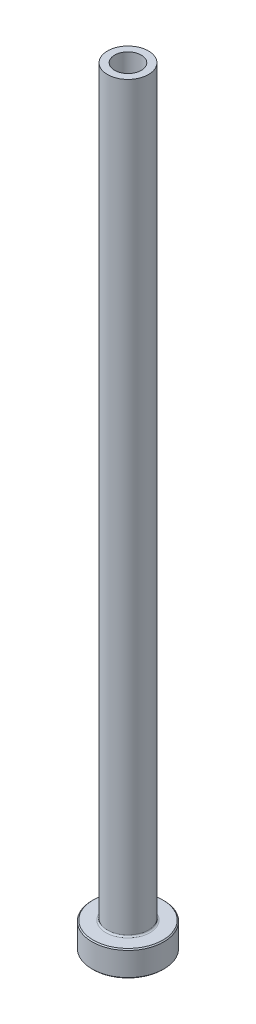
ISO-10303-21;
HEADER;
FILE_DESCRIPTION(('STEP AP214'),'2;1');
FILE_NAME('part.step','',(''),(''),'','','');
FILE_SCHEMA(('AUTOMOTIVE_DESIGN { 1 0 10303 214 1 1 1 1 }'));
ENDSEC;
DATA;
#1=APPLICATION_CONTEXT('core data for automotive mechanical design processes');
#2=APPLICATION_PROTOCOL_DEFINITION('international standard','automotive_design',2000,#1);
#3=PRODUCT_CONTEXT('',#1,'mechanical');
#4=PRODUCT('Part','Part','',(#3));
#5=PRODUCT_RELATED_PRODUCT_CATEGORY('part','',(#4));
#6=PRODUCT_DEFINITION_FORMATION('','',#4);
#7=PRODUCT_DEFINITION_CONTEXT('part definition',#1,'design');
#8=PRODUCT_DEFINITION('design','',#6,#7);
#9=PRODUCT_DEFINITION_SHAPE('','',#8);
#10=(LENGTH_UNIT() NAMED_UNIT(*) SI_UNIT(.MILLI.,.METRE.));
#11=(NAMED_UNIT(*) PLANE_ANGLE_UNIT() SI_UNIT($,.RADIAN.));
#12=(NAMED_UNIT(*) SI_UNIT($,.STERADIAN.) SOLID_ANGLE_UNIT());
#13=UNCERTAINTY_MEASURE_WITH_UNIT(LENGTH_MEASURE(1.E-05),#10,'distance_accuracy_value','');
#14=(GEOMETRIC_REPRESENTATION_CONTEXT(3) GLOBAL_UNCERTAINTY_ASSIGNED_CONTEXT((#13)) GLOBAL_UNIT_ASSIGNED_CONTEXT((#10,
#11,#12)) REPRESENTATION_CONTEXT('',''));
#15=CARTESIAN_POINT('',(0.,0.,0.));
#16=DIRECTION('',(0.,0.,1.));
#17=DIRECTION('',(1.,0.,0.));
#18=AXIS2_PLACEMENT_3D('',#15,#16,#17);
#19=CARTESIAN_POINT('',(0.,92.1876809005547,0.));
#20=DIRECTION('',(0.,1.,0.));
#21=DIRECTION('',(0.,0.,1.));
#22=AXIS2_PLACEMENT_3D('',#19,#20,#21);
#23=CYLINDRICAL_SURFACE('',#22,2.6);
#24=CARTESIAN_POINT('',(0.,150.,0.));
#25=DIRECTION('',(0.,1.,0.));
#26=DIRECTION('',(0.,0.,1.));
#27=AXIS2_PLACEMENT_3D('',#24,#25,#26);
#28=CIRCLE('',#27,2.6);
#29=CARTESIAN_POINT('',(0.,150.,2.6));
#30=VERTEX_POINT('',#29);
#31=EDGE_CURVE('E62',#30,#30,#28,.T.);
#32=ORIENTED_EDGE('',*,*,#31,.T.);
#33=EDGE_LOOP('',(#32));
#34=FACE_BOUND('',#33,.T.);
#35=CARTESIAN_POINT('',(0.,105.,0.));
#36=DIRECTION('',(0.,1.,0.));
#37=DIRECTION('',(0.,0.,1.));
#38=AXIS2_PLACEMENT_3D('',#35,#36,#37);
#39=CIRCLE('',#38,2.6);
#40=CARTESIAN_POINT('',(0.,105.,2.6));
#41=VERTEX_POINT('',#40);
#42=EDGE_CURVE('E71',#41,#41,#39,.T.);
#43=ORIENTED_EDGE('',*,*,#42,.F.);
#44=EDGE_LOOP('',(#43));
#45=FACE_BOUND('',#44,.T.);
#46=ADVANCED_FACE('F30',(#34,#45),#23,.F.);
#47=CARTESIAN_POINT('',(-2.6,150.,0.));
#48=DIRECTION('',(0.,1.,0.));
#49=DIRECTION('',(0.,0.,1.));
#50=AXIS2_PLACEMENT_3D('',#47,#48,#49);
#51=PLANE('',#50);
#52=CARTESIAN_POINT('',(0.,150.,0.));
#53=DIRECTION('',(0.,1.,0.));
#54=DIRECTION('',(0.,0.,1.));
#55=AXIS2_PLACEMENT_3D('',#52,#53,#54);
#56=CIRCLE('',#55,4.00000000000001);
#57=CARTESIAN_POINT('',(0.,150.,4.00000000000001));
#58=VERTEX_POINT('',#57);
#59=EDGE_CURVE('E65',#58,#58,#56,.T.);
#60=ORIENTED_EDGE('',*,*,#59,.T.);
#61=EDGE_LOOP('',(#60));
#62=FACE_BOUND('',#61,.T.);
#63=ORIENTED_EDGE('',*,*,#31,.F.);
#64=EDGE_LOOP('',(#63));
#65=FACE_BOUND('',#64,.T.);
#66=ADVANCED_FACE('F79',(#62,#65),#51,.T.);
#67=CARTESIAN_POINT('',(0.,92.1876809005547,0.));
#68=DIRECTION('',(0.,1.,0.));
#69=DIRECTION('',(0.,0.,1.));
#70=AXIS2_PLACEMENT_3D('',#67,#68,#69);
#71=CYLINDRICAL_SURFACE('',#70,4.);
#72=CARTESIAN_POINT('',(0.,5.3,0.));
#73=DIRECTION('',(0.,1.,0.));
#74=DIRECTION('',(0.,0.,1.));
#75=AXIS2_PLACEMENT_3D('',#72,#73,#74);
#76=CIRCLE('',#75,4.);
#77=CARTESIAN_POINT('',(0.,5.3,4.));
#78=VERTEX_POINT('',#77);
#79=EDGE_CURVE('E59',#78,#78,#76,.T.);
#80=ORIENTED_EDGE('',*,*,#79,.T.);
#81=EDGE_LOOP('',(#80));
#82=FACE_BOUND('',#81,.T.);
#83=ORIENTED_EDGE('',*,*,#59,.F.);
#84=EDGE_LOOP('',(#83));
#85=FACE_BOUND('',#84,.T.);
#86=ADVANCED_FACE('F85',(#82,#85),#71,.T.);
#87=CARTESIAN_POINT('',(-3.99999999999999,5.,0.));
#88=DIRECTION('',(0.,1.,0.));
#89=DIRECTION('',(0.,0.,1.));
#90=AXIS2_PLACEMENT_3D('',#87,#88,#89);
#91=PLANE('',#90);
#92=CARTESIAN_POINT('',(0.,5.,0.));
#93=DIRECTION('',(0.,1.,0.));
#94=DIRECTION('',(0.,0.,1.));
#95=AXIS2_PLACEMENT_3D('',#92,#93,#94);
#96=CIRCLE('',#95,6.8);
#97=CARTESIAN_POINT('',(0.,5.,6.8));
#98=VERTEX_POINT('',#97);
#99=EDGE_CURVE('E53',#98,#98,#96,.T.);
#100=ORIENTED_EDGE('',*,*,#99,.T.);
#101=EDGE_LOOP('',(#100));
#102=FACE_BOUND('',#101,.T.);
#103=CARTESIAN_POINT('',(0.,5.,0.));
#104=DIRECTION('',(0.,1.,0.));
#105=DIRECTION('',(0.,0.,1.));
#106=AXIS2_PLACEMENT_3D('',#103,#104,#105);
#107=CIRCLE('',#106,4.3);
#108=CARTESIAN_POINT('',(0.,5.,4.3));
#109=VERTEX_POINT('',#108);
#110=EDGE_CURVE('E56',#109,#109,#107,.F.);
#111=ORIENTED_EDGE('',*,*,#110,.T.);
#112=EDGE_LOOP('',(#111));
#113=FACE_BOUND('',#112,.T.);
#114=ADVANCED_FACE('F111',(#102,#113),#91,.T.);
#115=CARTESIAN_POINT('',(0.,92.1876809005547,0.));
#116=DIRECTION('',(0.,1.,0.));
#117=DIRECTION('',(0.,0.,1.));
#118=AXIS2_PLACEMENT_3D('',#115,#116,#117);
#119=CYLINDRICAL_SURFACE('',#118,6.99999999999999);
#120=CARTESIAN_POINT('',(0.,4.8,0.));
#121=DIRECTION('',(0.,1.,0.));
#122=DIRECTION('',(0.,0.,1.));
#123=AXIS2_PLACEMENT_3D('',#120,#121,#122);
#124=CIRCLE('',#123,6.99999999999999);
#125=CARTESIAN_POINT('',(0.,4.8,6.99999999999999));
#126=VERTEX_POINT('',#125);
#127=EDGE_CURVE('E45',#126,#126,#124,.F.);
#128=ORIENTED_EDGE('',*,*,#127,.T.);
#129=EDGE_LOOP('',(#128));
#130=FACE_BOUND('',#129,.T.);
#131=CARTESIAN_POINT('',(0.,0.200000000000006,0.));
#132=DIRECTION('',(0.,-1.,0.));
#133=DIRECTION('',(0.,0.,-1.));
#134=AXIS2_PLACEMENT_3D('',#131,#132,#133);
#135=CIRCLE('',#134,6.99999999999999);
#136=CARTESIAN_POINT('',(0.,0.200000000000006,-6.99999999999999));
#137=VERTEX_POINT('',#136);
#138=EDGE_CURVE('E50',#137,#137,#135,.F.);
#139=ORIENTED_EDGE('',*,*,#138,.T.);
#140=EDGE_LOOP('',(#139));
#141=FACE_BOUND('',#140,.T.);
#142=ADVANCED_FACE('F108',(#130,#141),#119,.T.);
#143=CARTESIAN_POINT('',(-6.99999999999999,0.,0.));
#144=DIRECTION('',(0.,-1.,0.));
#145=DIRECTION('',(0.,0.,-1.));
#146=AXIS2_PLACEMENT_3D('',#143,#144,#145);
#147=PLANE('',#146);
#148=CARTESIAN_POINT('',(0.,0.,0.));
#149=DIRECTION('',(0.,-1.,0.));
#150=DIRECTION('',(0.,0.,-1.));
#151=AXIS2_PLACEMENT_3D('',#148,#149,#150);
#152=CIRCLE('',#151,3.34999999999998);
#153=CARTESIAN_POINT('',(0.,0.,-3.34999999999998));
#154=VERTEX_POINT('',#153);
#155=EDGE_CURVE('E37',#154,#154,#152,.F.);
#156=ORIENTED_EDGE('',*,*,#155,.T.);
#157=EDGE_LOOP('',(#156));
#158=FACE_BOUND('',#157,.T.);
#159=CARTESIAN_POINT('',(0.,0.,0.));
#160=DIRECTION('',(0.,-1.,0.));
#161=DIRECTION('',(0.,0.,-1.));
#162=AXIS2_PLACEMENT_3D('',#159,#160,#161);
#163=CIRCLE('',#162,6.79999999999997);
#164=CARTESIAN_POINT('',(0.,0.,-6.79999999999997));
#165=VERTEX_POINT('',#164);
#166=EDGE_CURVE('E41',#165,#165,#163,.T.);
#167=ORIENTED_EDGE('',*,*,#166,.T.);
#168=EDGE_LOOP('',(#167));
#169=FACE_BOUND('',#168,.T.);
#170=ADVANCED_FACE('F110',(#158,#169),#147,.T.);
#171=CARTESIAN_POINT('',(0.,92.1876809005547,0.));
#172=DIRECTION('',(0.,1.,0.));
#173=DIRECTION('',(0.,0.,1.));
#174=AXIS2_PLACEMENT_3D('',#171,#172,#173);
#175=CYLINDRICAL_SURFACE('',#174,2.85);
#176=CARTESIAN_POINT('',(0.,0.499999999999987,0.));
#177=DIRECTION('',(0.,-1.,0.));
#178=DIRECTION('',(0.,0.,-1.));
#179=AXIS2_PLACEMENT_3D('',#176,#177,#178);
#180=CIRCLE('',#179,2.85);
#181=CARTESIAN_POINT('',(0.,0.499999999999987,-2.85));
#182=VERTEX_POINT('',#181);
#183=EDGE_CURVE('E10',#182,#182,#180,.T.);
#184=ORIENTED_EDGE('',*,*,#183,.T.);
#185=EDGE_LOOP('',(#184));
#186=FACE_BOUND('',#185,.T.);
#187=CARTESIAN_POINT('',(0.,93.,0.));
#188=DIRECTION('',(0.,1.,0.));
#189=DIRECTION('',(0.,0.,1.));
#190=AXIS2_PLACEMENT_3D('',#187,#188,#189);
#191=CIRCLE('',#190,2.85);
#192=CARTESIAN_POINT('',(0.,93.,2.85));
#193=VERTEX_POINT('',#192);
#194=EDGE_CURVE('E68',#193,#193,#191,.T.);
#195=ORIENTED_EDGE('',*,*,#194,.T.);
#196=EDGE_LOOP('',(#195));
#197=FACE_BOUND('',#196,.T.);
#198=ADVANCED_FACE('F118',(#186,#197),#175,.F.);
#199=CARTESIAN_POINT('',(0.,93.,0.));
#200=DIRECTION('',(0.,-1.,0.));
#201=DIRECTION('',(0.,0.,-1.));
#202=AXIS2_PLACEMENT_3D('',#199,#200,#201);
#203=CONICAL_SURFACE('',#202,2.85,0.0208303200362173);
#204=ORIENTED_EDGE('',*,*,#42,.T.);
#205=EDGE_LOOP('',(#204));
#206=FACE_BOUND('',#205,.T.);
#207=ORIENTED_EDGE('',*,*,#194,.F.);
#208=EDGE_LOOP('',(#207));
#209=FACE_BOUND('',#208,.T.);
#210=ADVANCED_FACE('F75',(#206,#209),#203,.F.);
#211=CARTESIAN_POINT('',(0.,5.3,0.));
#212=DIRECTION('',(0.,1.,0.));
#213=DIRECTION('',(0.,0.,1.));
#214=AXIS2_PLACEMENT_3D('',#211,#212,#213);
#215=TOROIDAL_SURFACE('',#214,4.3,0.3);
#216=ORIENTED_EDGE('',*,*,#110,.F.);
#217=EDGE_LOOP('',(#216));
#218=FACE_BOUND('',#217,.T.);
#219=ORIENTED_EDGE('',*,*,#79,.F.);
#220=EDGE_LOOP('',(#219));
#221=FACE_BOUND('',#220,.T.);
#222=ADVANCED_FACE('F90',(#218,#221),#215,.F.);
#223=CARTESIAN_POINT('',(0.,5.,0.));
#224=DIRECTION('',(0.,-1.,0.));
#225=DIRECTION('',(0.,0.,-1.));
#226=AXIS2_PLACEMENT_3D('',#223,#224,#225);
#227=CONICAL_SURFACE('',#226,6.8,0.785398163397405);
#228=ORIENTED_EDGE('',*,*,#127,.F.);
#229=EDGE_LOOP('',(#228));
#230=FACE_BOUND('',#229,.T.);
#231=ORIENTED_EDGE('',*,*,#99,.F.);
#232=EDGE_LOOP('',(#231));
#233=FACE_BOUND('',#232,.T.);
#234=ADVANCED_FACE('F93',(#230,#233),#227,.T.);
#235=CARTESIAN_POINT('',(0.,0.200000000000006,0.));
#236=DIRECTION('',(0.,1.,0.));
#237=DIRECTION('',(0.,0.,1.));
#238=AXIS2_PLACEMENT_3D('',#235,#236,#237);
#239=CONICAL_SURFACE('',#238,6.99999999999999,0.785398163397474);
#240=ORIENTED_EDGE('',*,*,#166,.F.);
#241=EDGE_LOOP('',(#240));
#242=FACE_BOUND('',#241,.T.);
#243=ORIENTED_EDGE('',*,*,#138,.F.);
#244=EDGE_LOOP('',(#243));
#245=FACE_BOUND('',#244,.T.);
#246=ADVANCED_FACE('F96',(#242,#245),#239,.T.);
#247=CARTESIAN_POINT('',(0.,0.,0.));
#248=DIRECTION('',(0.,-1.,0.));
#249=DIRECTION('',(0.,0.,-1.));
#250=AXIS2_PLACEMENT_3D('',#247,#248,#249);
#251=CONICAL_SURFACE('',#250,3.34999999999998,0.785398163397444);
#252=ORIENTED_EDGE('',*,*,#183,.F.);
#253=EDGE_LOOP('',(#252));
#254=FACE_BOUND('',#253,.T.);
#255=ORIENTED_EDGE('',*,*,#155,.F.);
#256=EDGE_LOOP('',(#255));
#257=FACE_BOUND('',#256,.T.);
#258=ADVANCED_FACE('F32',(#254,#257),#251,.F.);
#259=CLOSED_SHELL('',(#46,#66,#86,#114,#142,#170,#198,#210,#222,#234,#246,#258));
#260=MANIFOLD_SOLID_BREP('B2',#259);
#261=ADVANCED_BREP_SHAPE_REPRESENTATION('',(#18,#260),#14);
#262=SHAPE_DEFINITION_REPRESENTATION(#9,#261);
ENDSEC;
END-ISO-10303-21;
